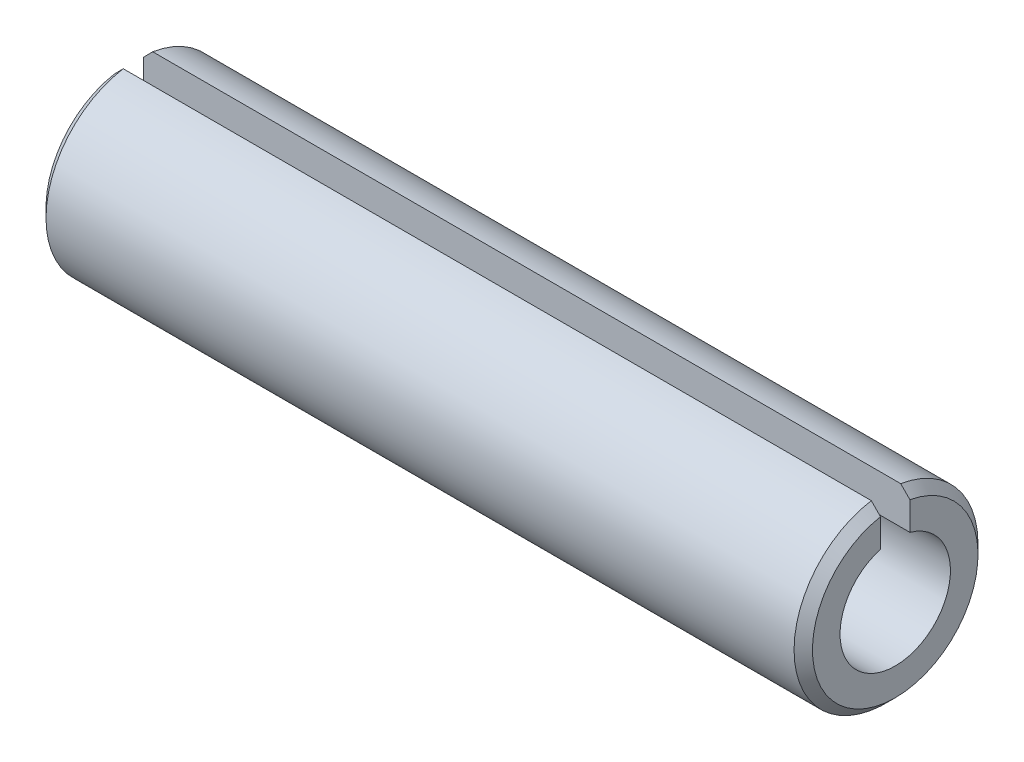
from build123d import *

# Parameters (mm, degrees)
ENL_V_MAT_EXTRU_2_DEPTH = 26.357444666


with BuildPart() as part:
    # Esquisse1 → Base-R_volution (revolve)
    with BuildSketch(Plane.XY, mode=Mode.PRIVATE) as base_r_volution_sk:
        Polygon((0, 1.8), (0, 2.7), (0.3, 3), (24.7, 3), (25, 2.7), (25, 1.8), align=None)
    revolve(base_r_volution_sk.sketch.rotate(Axis((0, 0, 0), (1, 0, 0)), 90), axis=Axis((0, 0, 0), (1, 0, 0)))

    # Esquisse2 → Enl_v. mat.-Extru.2 (cut, through all)
    with BuildSketch(Plane(origin=(0, 0, 0), x_dir=(0, 0, -1), z_dir=(1, 0, 0))):
        with BuildLine():
            Line((0.48, 2.961351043), (0.48, 1.734819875))
            ThreePointArc((0.48, 1.734819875), (0, 1.8), (-0.48, 1.734819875))
            Line((-0.48, 1.734819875), (-0.48, 2.961351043))
            ThreePointArc((-0.48, 2.961351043), (0, 3), (0.48, 2.961351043))
        make_face()
    extrude(amount=ENL_V_MAT_EXTRU_2_DEPTH, mode=Mode.SUBTRACT)


solid = part.part
